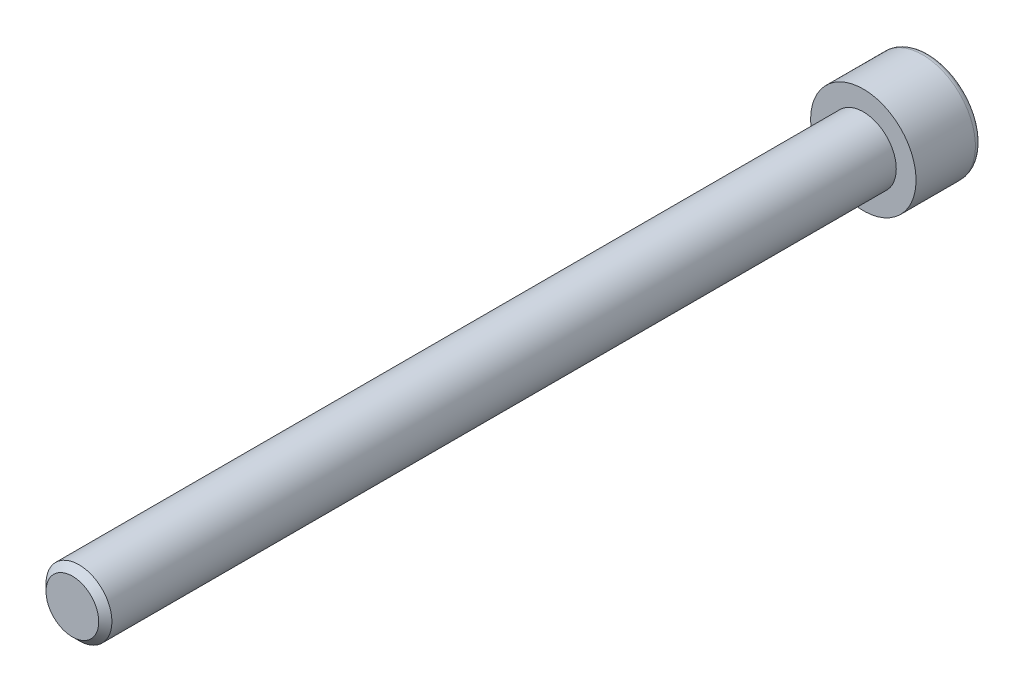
from build123d import *

# Parameters (mm, degrees)
ENLEV_MAT_EXTRU1_DEPTH = 5
ESQUISSE3_W            = 5
ESQUISSE3_H            = 120
CHANFREIN1_SIZE        = 1


with BuildPart() as part:
    # Esquisse1 → Base-R_volution (revolve)
    with BuildSketch(Plane(origin=(0, 0, 0), x_dir=(1, 0, 0), z_dir=(0, 1, 0)), mode=Mode.PRIVATE) as base_r_volution_sk:
        with BuildLine():
            Line((0, 0), (8, 0))
            Line((8, 0), (8, 9))
            ThreePointArc((8, 9), (7.707106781, 9.707106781), (7, 10))
            Line((7, 10), (0, 10))
            Line((0, 10), (0, 0))
        make_face()
    revolve(base_r_volution_sk.sketch.rotate(Axis((0, 0, 0), (0, 0, -1)), 180), axis=Axis((0, 0, 0), (0, 0, -1)))

    # Esquisse2 → enlev-mat-Extru1 (cut)
    with BuildSketch(Plane.XY.offset(-10)):
        Polygon((4, -2.309401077), (4, 2.309401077), (0, 4.618802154), (-4, 2.309401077), (-4, -2.309401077), (0, -4.618802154), align=None)
    extrude(amount=ENLEV_MAT_EXTRU1_DEPTH, mode=Mode.SUBTRACT)

    # Esquisse3 → Boss.-R_vol.1 (revolve)
    with BuildSketch(Plane(origin=(0, 0, 0), x_dir=(1, 0, 0), z_dir=(0, 1, 0))):
        with Locations((2.5, -60)):
            Rectangle(ESQUISSE3_W, ESQUISSE3_H)
    revolve(axis=Axis((0, 0, 0), (0, 0, 1)))

    # Chanfrein1
    chanfrein1_edges = [part.edges().sort_by_distance(p)[0] for p in [
        (-5, 0, 120),
    ]]
    chamfer(chanfrein1_edges, length=CHANFREIN1_SIZE)

    # Esquisse6 → Enl_vement de mati_re-R_volution1 (revolve, cut)
    with BuildSketch(Plane(origin=(0, 0, 0), x_dir=(-1, 0, 0), z_dir=(0, 1, 0)), mode=Mode.PRIVATE) as enl_vement_de_mati_re_r_volution1_sk:
        Polygon((3, 74.008164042), (5.707749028, 78.698122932), (5.707749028, 74.008164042), align=None)
    revolve(enl_vement_de_mati_re_r_volution1_sk.sketch.rotate(Axis((17.175965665, 0, 74.008164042), (-1, 0, 0)), 270), axis=Axis((17.175965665, 0, 74.008164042), (-1, 0, 0)), mode=Mode.SUBTRACT)


solid = part.part
